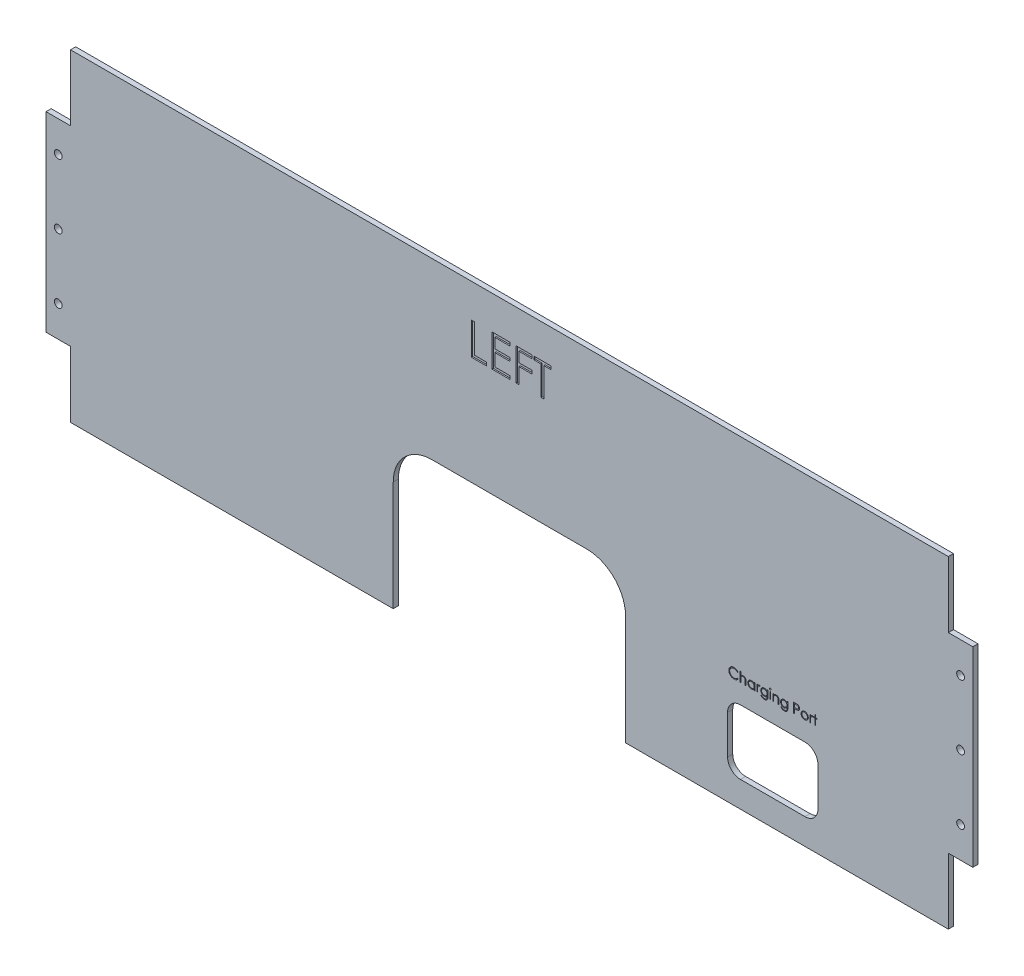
from build123d import *

# Parameters (mm, degrees)
BOSS_EXTRU_1_DEPTH      = 4
ESQUISSE2_R             = 3
ENL_V_MAT_EXTRU_1_DEPTH = 381.160492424
ESQUISSE3_W             = 180
ESQUISSE3_H             = 115
ENL_V_MAT_EXTRU_2_DEPTH = 381.160492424
CONG_1_R                = 30
ENL_V_MAT_EXTRU_3_DEPTH = 1
ENL_V_MAT_EXTRU_4_REACH = 382.16
ESQUISSE6_W             = 0.664850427
ESQUISSE6_H             = 5.413782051
ENL_V_MAT_EXTRU_5_DEPTH = 1


with BuildPart() as part:
    # Esquisse1 → Boss.-Extru.1 (new body)
    with BuildSketch(Plane.XY):
        Polygon((340, 125), (-340, 125), (-340, 74), (-359, 74), (-359, -74), (-340, -74), (-340, -125), (340, -125), (340, -74), (359, -74), (359, 74), (340, 74), align=None)
    extrude(amount=BOSS_EXTRU_1_DEPTH)

    # Esquisse2 → Enl_v. mat.-Extru.1 (cut, through all)
    with BuildSketch(Plane.XY.offset(4)):
        with Locations((-349.5, 50)):
            Circle(ESQUISSE2_R)
        with Locations((-349.5, -50)):
            Circle(ESQUISSE2_R)
        with Locations((-349.5, 0)):
            Circle(ESQUISSE2_R)
        with Locations(Location((349.5, 0, 0), (0, 0, 180))):
            Circle(ESQUISSE2_R)
        with Locations(Location((349.5, -50, 0), (0, 0, 180))):
            Circle(ESQUISSE2_R)
        with Locations(Location((349.5, 50, 0), (0, 0, 180))):
            Circle(ESQUISSE2_R)
    extrude(amount=-ENL_V_MAT_EXTRU_1_DEPTH, mode=Mode.SUBTRACT)

    # Esquisse3 → Enl_v. mat.-Extru.2 (cut, through all)
    with BuildSketch(Plane.XY.offset(4)):
        with Locations((0, -67.5)):
            Rectangle(ESQUISSE3_W, ESQUISSE3_H)
    extrude(amount=-ENL_V_MAT_EXTRU_2_DEPTH, mode=Mode.SUBTRACT)

    # Cong_1
    cong_1_edges = [part.edges().sort_by_distance(p)[0] for p in [
        (-90, -10, 2),
        (90, -10, 2),
    ]]
    fillet(cong_1_edges, radius=CONG_1_R)

    # Esquisse4 → Enl_v. mat.-Extru.3 (cut)
    with BuildSketch(Plane.XY.offset(4)):
        Polygon((-29.487179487, 99), (-27.243589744, 99), (-27.243589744, 76.564102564), (-17.628205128, 76.564102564), (-17.628205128, 74), (-29.487179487, 74), align=None)
        Polygon((-13.461538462, 99), (0.641025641, 99), (0.641025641, 96.435897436), (-11.217948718, 96.435897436), (-11.217948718, 88.743589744), (0.641025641, 88.743589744), (0.641025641, 86.179487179), (-11.217948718, 86.179487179), (-11.217948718, 76.564102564), (0.641025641, 76.564102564), (0.641025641, 74), (-13.461538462, 74), align=None)
        Polygon((5.128205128, 99), (17.307692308, 99), (17.307692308, 96.435897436), (7.371794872, 96.435897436), (7.371794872, 88.743589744), (17.307692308, 88.743589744), (17.307692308, 86.179487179), (7.371794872, 86.179487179), (7.371794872, 74), (5.128205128, 74), align=None)
        Polygon((18.91025641, 96.435897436), (18.91025641, 99), (32.051282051, 99), (32.051282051, 96.435897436), (26.602564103, 96.435897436), (26.602564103, 74), (24.358974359, 74), (24.358974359, 96.435897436), align=None)
    extrude(amount=-ENL_V_MAT_EXTRU_3_DEPTH, mode=Mode.SUBTRACT)

    # Esquisse5 → Enl_v. mat.-Extru.4 (cut, up to next)
    with BuildSketch(Plane.XY.offset(4), mode=Mode.PRIVATE) as enl_v_mat_extru_4_sk1:
        with BuildLine():
            Line((229, -55), (179, -55))
            ThreePointArc((179, -55), (171.928932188, -57.928932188), (169, -65))
            Line((169, -65), (169, -95))
            ThreePointArc((169, -95), (171.928932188, -102.071067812), (179, -105))
            Line((179, -105), (229, -105))
            ThreePointArc((229, -105), (236.071067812, -102.071067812), (239, -95))
            Line((239, -95), (239, -65))
            ThreePointArc((239, -65), (236.071067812, -57.928932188), (229, -55))
        make_face()
    enl_v_mat_extru_4_tool1 = extrude(enl_v_mat_extru_4_sk1.sketch, amount=-ENL_V_MAT_EXTRU_4_REACH, mode=Mode.PRIVATE) & part.part
    add(enl_v_mat_extru_4_tool1.solids().sort_by_distance((204, -80, 4))[0], mode=Mode.SUBTRACT)

    # Esquisse6 → Enl_v. mat.-Extru.5 (cut)
    # profile 1 of 13: a face of its own
    with BuildSketch(Plane.XY.offset(4)):
        with BuildLine():
            Line((177.216025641, -33.951048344), (176.634281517, -34.396260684))
            add(Edge.make_bspline(
                [(176.634281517, -34.396260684), (176.592782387, -34.346802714), (176.510343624, -34.248553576), (176.377714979, -34.110590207), (176.239493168, -33.981335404), (176.095731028, -33.860173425), (175.943840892, -33.751341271), (175.787502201, -33.649167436), (175.624099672, -33.557584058), (175.398141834, -33.446537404), (175.102553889, -33.330658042), (174.730454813, -33.233496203), (174.342022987, -33.171644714), (174.077021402, -33.1649458), (173.942230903, -33.161538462)],
                knots=[0, 0, 0, 0, 0.757959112, 1.505699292, 2.245454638, 2.979532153, 3.711538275, 4.438200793, 5.171680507, 5.909471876, 7.393775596, 8.890124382, 10.418191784, 12, 12, 12, 12], degree=3))
            add(Edge.make_bspline(
                [(173.942230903, -33.161538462), (173.867971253, -33.162393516), (173.720141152, -33.164095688), (173.500751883, -33.186551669), (173.285459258, -33.218113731), (173.074403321, -33.264945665), (172.867852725, -33.324154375), (172.664457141, -33.394904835), (172.467161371, -33.482439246), (172.273236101, -33.579188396), (172.087436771, -33.688466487), (171.911636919, -33.807663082), (171.746477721, -33.935444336), (171.591828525, -34.072289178), (171.447531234, -34.217581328), (171.314631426, -34.372869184), (171.193588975, -34.537656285), (171.082004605, -34.709769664), (170.982070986, -34.88870799), (170.898399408, -35.075133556), (170.824305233, -35.265853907), (170.765675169, -35.463023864), (170.719268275, -35.665256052), (170.687248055, -35.87309322), (170.665047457, -36.086101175), (170.663353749, -36.230477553), (170.6625, -36.303253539)],
                knots=[0, 0, 0, 0, 1.054917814, 2.100044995, 3.131103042, 4.146048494, 5.169673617, 6.183595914, 7.203665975, 8.234915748, 9.262203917, 10.264457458, 11.251630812, 12.227803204, 13.197192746, 14.159520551, 15.12972552, 16.100847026, 17.073214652, 18.039054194, 19.002613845, 19.979014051, 20.95965708, 21.949030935, 22.966165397, 24, 24, 24, 24], degree=3))
            add(Edge.make_bspline(
                [(170.6625, -36.303253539), (170.66517085, -36.412751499), (170.67041471, -36.627736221), (170.717083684, -36.942634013), (170.788002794, -37.244302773), (170.894292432, -37.530856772), (171.025354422, -37.805829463), (171.190963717, -38.06456837), (171.382768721, -38.310983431), (171.603482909, -38.539251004), (171.845641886, -38.747771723), (172.105458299, -38.931393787), (172.382285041, -39.084460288), (172.673065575, -39.211832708), (172.980037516, -39.309742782), (173.302648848, -39.378670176), (173.640197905, -39.423632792), (173.870849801, -39.427937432), (173.988236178, -39.430128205)],
                knots=[0, 0, 0, 0, 1.029171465, 2.020641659, 2.987623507, 3.938342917, 4.889210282, 5.84687017, 6.821220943, 7.821438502, 8.827599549, 9.822697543, 10.807740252, 11.797342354, 12.80366471, 13.83203677, 14.896651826, 16, 16, 16, 16], degree=3))
            add(Edge.make_bspline(
                [(173.988236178, -39.430128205), (174.117570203, -39.426553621), (174.372130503, -39.419517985), (174.745442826, -39.359914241), (175.102811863, -39.263271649), (175.444256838, -39.128021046), (175.768815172, -38.95219952), (176.07699477, -38.73905568), (176.369055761, -38.486562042), (176.544678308, -38.293769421), (176.634281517, -38.195405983)],
                knots=[0, 0, 0, 0, 1.028121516, 2.023589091, 2.998037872, 3.967518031, 4.937445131, 5.927275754, 6.942489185, 8, 8, 8, 8], degree=3))
            Line((176.634281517, -38.195405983), (177.216025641, -38.636166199))
            add(Edge.make_bspline(
                [(177.216025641, -38.636166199), (177.169208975, -38.696572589), (177.075799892, -38.817096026), (176.92454709, -38.987004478), (176.765210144, -39.146821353), (176.596605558, -39.295258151), (176.420672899, -39.435285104), (176.234253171, -39.56292398), (176.039797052, -39.679956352), (175.837963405, -39.787116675), (175.628966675, -39.882191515), (175.413057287, -39.963585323), (175.191165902, -40.033699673), (174.963282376, -40.091382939), (174.728934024, -40.136406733), (174.488966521, -40.166505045), (174.242861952, -40.18712543), (174.07682761, -40.189004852), (173.992688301, -40.189957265)],
                knots=[0, 0, 0, 0, 0.986787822, 1.968848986, 2.935600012, 3.899624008, 4.868462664, 5.837806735, 6.815139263, 7.798259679, 8.787526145, 9.778297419, 10.776456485, 11.791383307, 12.812564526, 13.85620153, 14.913611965, 16, 16, 16, 16], degree=3))
            add(Edge.make_bspline(
                [(173.992688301, -40.189957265), (173.913009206, -40.189402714), (173.755453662, -40.188306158), (173.522834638, -40.170542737), (173.296373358, -40.146307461), (173.076717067, -40.10981585), (172.862667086, -40.066753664), (172.656163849, -40.009029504), (172.455175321, -39.944367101), (172.260509, -39.868368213), (172.071999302, -39.782608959), (171.890254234, -39.685683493), (171.715357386, -39.57840688), (171.545589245, -39.463143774), (171.383457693, -39.336191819), (171.227557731, -39.199314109), (171.077015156, -39.052971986), (170.983876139, -38.94744588), (170.93704761, -38.894389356)],
                knots=[0, 0, 0, 0, 1.114604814, 2.203992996, 3.262667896, 4.300477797, 5.318619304, 6.316056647, 7.298880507, 8.271930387, 9.238335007, 10.195173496, 11.151986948, 12.108099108, 13.064862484, 14.031167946, 15.010108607, 16, 16, 16, 16], degree=3))
            add(Edge.make_bspline(
                [(170.93704761, -38.894389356), (170.862042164, -38.802227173), (170.712936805, -38.619015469), (170.522170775, -38.322076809), (170.358875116, -38.012052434), (170.226846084, -37.687313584), (170.123631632, -37.348588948), (170.052128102, -36.995707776), (170.005663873, -36.628999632), (170.000350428, -36.379578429), (169.997649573, -36.25279614)],
                knots=[0, 0, 0, 0, 0.994628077, 1.977248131, 2.950237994, 3.925870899, 4.908910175, 5.911660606, 6.938484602, 8, 8, 8, 8], degree=3))
            add(Edge.make_bspline(
                [(169.997649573, -36.25279614), (170.000941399, -36.11954043), (170.007417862, -35.85736814), (170.062442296, -35.472613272), (170.150958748, -35.103992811), (170.276682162, -34.752194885), (170.436078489, -34.415369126), (170.632984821, -34.096088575), (170.865113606, -33.792311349), (171.130644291, -33.508646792), (171.421828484, -33.249271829), (171.733653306, -33.021082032), (172.065508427, -32.831179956), (172.41373788, -32.672438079), (172.78094924, -32.550423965), (173.166359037, -32.46500972), (173.569243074, -32.411845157), (173.844118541, -32.405124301), (173.983784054, -32.401709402)],
                knots=[0, 0, 0, 0, 1.032925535, 2.032216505, 3.007276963, 3.968222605, 4.92396291, 5.891752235, 6.871517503, 7.883894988, 8.900124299, 9.891468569, 10.874487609, 11.85992873, 12.854644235, 13.869047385, 14.917252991, 16, 16, 16, 16], degree=3))
            add(Edge.make_bspline(
                [(173.983784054, -32.401709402), (174.068904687, -32.402729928), (174.237392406, -32.404749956), (174.48663552, -32.424447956), (174.729295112, -32.45728509), (174.965538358, -32.501980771), (175.196514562, -32.557452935), (175.420458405, -32.629716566), (175.638683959, -32.712343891), (175.849814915, -32.807505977), (176.052838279, -32.914327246), (176.24769082, -33.031623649), (176.432824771, -33.159249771), (176.609542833, -33.296120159), (176.774888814, -33.445130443), (176.933557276, -33.602182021), (177.080159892, -33.771798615), (177.170654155, -33.891189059), (177.216025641, -33.951048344)],
                knots=[0, 0, 0, 0, 1.096760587, 2.17092713, 3.219439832, 4.250915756, 5.268269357, 6.278326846, 7.281116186, 8.274029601, 9.260640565, 10.235837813, 11.203064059, 12.156899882, 13.114053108, 14.069676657, 15.032185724, 16, 16, 16, 16], degree=3))
        make_face()
    # profile 2 of 13: a face of its own
    with BuildSketch(Plane.XY.offset(4)):
        with BuildLine():
            Line((178.545726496, -32.401709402), (179.210576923, -32.401709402))
            Line((179.210576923, -32.401709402), (179.210576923, -35.608722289))
            add(Edge.make_bspline(
                [(179.210576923, -35.608722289), (179.281945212, -35.519517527), (179.420902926, -35.345831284), (179.654786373, -35.11921843), (179.894966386, -34.922794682), (180.149738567, -34.766435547), (180.414428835, -34.642914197), (180.690153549, -34.555310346), (180.976963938, -34.501438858), (181.171750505, -34.494668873), (181.270426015, -34.491239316)],
                knots=[0, 0, 0, 0, 1.125788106, 2.19196713, 3.20547328, 4.180437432, 5.132270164, 6.079753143, 7.027236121, 8, 8, 8, 8], degree=3))
            add(Edge.make_bspline(
                [(181.270426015, -34.491239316), (181.37060868, -34.49493381), (181.56669032, -34.502164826), (181.852189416, -34.55934315), (182.118806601, -34.65704306), (182.365749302, -34.790746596), (182.587628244, -34.957270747), (182.784160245, -35.149530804), (182.944689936, -35.372360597), (183.053908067, -35.578219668), (183.12497178, -35.761393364), (183.169954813, -35.918527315), (183.208095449, -36.093622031), (183.241326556, -36.286587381), (183.263474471, -36.498349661), (183.281264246, -36.727953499), (183.293914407, -36.975385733), (183.294404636, -37.146666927), (183.29465812, -37.23523137)],
                knots=[0, 0, 0, 0, 1.235656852, 2.418478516, 3.575258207, 4.727955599, 5.870717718, 6.98870536, 8.107142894, 9.245821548, 9.854588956, 10.528768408, 11.260415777, 12.065282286, 12.943670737, 13.886611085, 14.907229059, 16, 16, 16, 16], degree=3))
            Line((183.29465812, -37.23523137), (183.29465812, -40))
            Line((183.29465812, -40), (182.629807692, -40))
            Line((182.629807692, -40), (182.629807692, -37.453385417))
            add(Edge.make_bspline(
                [(182.629807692, -37.453385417), (182.629404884, -37.379677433), (182.62863438, -37.238686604), (182.626087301, -37.036828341), (182.620401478, -36.853744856), (182.611213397, -36.690022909), (182.601550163, -36.545434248), (182.588250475, -36.42018885), (182.572777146, -36.314114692), (182.558873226, -36.250266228), (182.552637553, -36.221631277)],
                knots=[0, 0, 0, 0, 1.430932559, 2.737130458, 3.918967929, 4.986496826, 5.920444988, 6.731744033, 7.431208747, 8, 8, 8, 8], degree=3))
            add(Edge.make_bspline(
                [(182.552637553, -36.221631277), (182.528456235, -36.137611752), (182.48196779, -35.976084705), (182.373916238, -35.756665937), (182.238959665, -35.569584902), (182.074182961, -35.417366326), (181.882501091, -35.297961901), (181.662664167, -35.215268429), (181.416741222, -35.163944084), (181.24348894, -35.158780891), (181.153186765, -35.156089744)],
                knots=[0, 0, 0, 0, 1.090059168, 2.095632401, 3.037101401, 3.955032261, 4.878929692, 5.839099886, 6.873700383, 8, 8, 8, 8], degree=3))
            add(Edge.make_bspline(
                [(181.153186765, -35.156089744), (181.099703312, -35.157096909), (180.99386094, -35.159090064), (180.836912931, -35.179100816), (180.68466308, -35.211800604), (180.535645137, -35.256048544), (180.393017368, -35.316258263), (180.252622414, -35.385960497), (180.118438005, -35.471279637), (179.988081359, -35.567007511), (179.866759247, -35.672988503), (179.753883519, -35.784847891), (179.653260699, -35.903963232), (179.562098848, -36.028423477), (179.48340481, -36.159935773), (179.414712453, -36.297231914), (179.356428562, -36.440492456), (179.327466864, -36.539923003), (179.312975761, -36.589673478)],
                knots=[0, 0, 0, 0, 1.024319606, 2.027102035, 3.025350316, 4.005802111, 5.00026367, 5.987881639, 7.005602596, 8.042517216, 9.083927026, 10.089214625, 11.084353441, 12.06828073, 13.041928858, 14.016821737, 15.00770877, 16, 16, 16, 16], degree=3))
            add(Edge.make_bspline(
                [(179.312975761, -36.589673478), (179.304637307, -36.625701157), (179.286466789, -36.704209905), (179.266750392, -36.833695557), (179.249102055, -36.984161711), (179.234182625, -37.155380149), (179.225032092, -37.347978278), (179.215172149, -37.560641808), (179.21150182, -37.794702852), (179.210894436, -37.95746501), (179.210576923, -38.042549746)],
                knots=[0, 0, 0, 0, 0.607992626, 1.324890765, 2.152360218, 3.099583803, 4.150613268, 5.323148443, 6.60066238, 8, 8, 8, 8], degree=3))
            Line((179.210576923, -38.042549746), (179.210576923, -40))
            Line((179.210576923, -40), (178.545726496, -40))
            Line((178.545726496, -40), (178.545726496, -32.401709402))
        make_face()
    # profile 3 of 13: a face of its own
    with BuildSketch(Plane.XY.offset(4)):
        with BuildLine():
            Line((190.323076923, -34.586217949), (190.323076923, -40))
            Line((190.323076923, -40), (189.658226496, -40))
            Line((189.658226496, -40), (189.658226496, -39.063570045))
            add(Edge.make_bspline(
                [(189.658226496, -39.063570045), (189.583256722, -39.148320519), (189.436952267, -39.313712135), (189.1926019, -39.529786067), (188.933589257, -39.708386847), (188.661171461, -39.852637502), (188.375594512, -39.960994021), (188.077491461, -40.038011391), (187.766740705, -40.087528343), (187.554539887, -40.092472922), (187.447005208, -40.094978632)],
                knots=[0, 0, 0, 0, 1.074387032, 2.096679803, 3.090159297, 4.057316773, 5.018401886, 5.985159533, 6.978961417, 8, 8, 8, 8], degree=3))
            add(Edge.make_bspline(
                [(187.447005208, -40.094978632), (187.351399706, -40.092382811), (187.162861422, -40.087263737), (186.885516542, -40.047550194), (186.618621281, -39.983773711), (186.361923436, -39.895083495), (186.117084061, -39.777437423), (185.882006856, -39.636591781), (185.657909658, -39.468865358), (185.448208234, -39.277120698), (185.2551005, -39.068851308), (185.085637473, -38.846716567), (184.944343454, -38.611677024), (184.82619095, -38.366708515), (184.735182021, -38.109925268), (184.671737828, -37.842215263), (184.632070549, -37.563895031), (184.626953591, -37.374369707), (184.624358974, -37.278268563)],
                knots=[0, 0, 0, 0, 1.033919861, 2.038935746, 3.024066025, 3.998881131, 4.97069526, 5.957263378, 6.95902576, 7.993208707, 9.027059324, 10.027763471, 11.009749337, 11.988697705, 12.965288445, 13.950418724, 14.960734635, 16, 16, 16, 16], degree=3))
            add(Edge.make_bspline(
                [(184.624358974, -37.278268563), (184.627011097, -37.184153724), (184.632254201, -36.998093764), (184.671313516, -36.724453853), (184.736995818, -36.460890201), (184.829172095, -36.208251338), (184.9473709, -35.966231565), (185.091152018, -35.734659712), (185.260525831, -35.512897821), (185.455793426, -35.306160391), (185.667322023, -35.115193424), (185.89361217, -34.949227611), (186.129034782, -34.805893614), (186.377241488, -34.69232709), (186.634558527, -34.600444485), (186.903276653, -34.536874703), (187.182277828, -34.499415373), (187.37169937, -34.493990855), (187.467781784, -34.491239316)],
                knots=[0, 0, 0, 0, 1.020392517, 2.01726096, 2.990465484, 3.961182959, 4.928053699, 5.906110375, 6.912531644, 7.948652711, 8.985773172, 9.998621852, 10.987621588, 11.969261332, 12.953316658, 13.946091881, 14.958173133, 16, 16, 16, 16], degree=3))
            add(Edge.make_bspline(
                [(187.467781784, -34.491239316), (187.578271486, -34.494282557), (187.794936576, -34.500250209), (188.111860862, -34.549912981), (188.411675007, -34.633814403), (188.696693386, -34.747939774), (188.965892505, -34.899596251), (189.216723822, -35.090900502), (189.451812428, -35.320646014), (189.588084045, -35.497113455), (189.658226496, -35.587945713)],
                knots=[0, 0, 0, 0, 1.038897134, 2.037228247, 3.008116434, 3.962042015, 4.918381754, 5.904844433, 6.921570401, 8, 8, 8, 8], degree=3))
            Line((189.658226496, -35.587945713), (189.658226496, -34.586217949))
            Line((189.658226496, -34.586217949), (190.323076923, -34.586217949))
        make_face()
        with BuildLine():
            add(Edge.make_bspline(
                [(187.476686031, -35.156089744), (187.379500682, -35.15954761), (187.187672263, -35.166372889), (186.906062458, -35.219656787), (186.636582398, -35.308312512), (186.380579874, -35.429559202), (186.142098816, -35.582020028), (185.928963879, -35.766426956), (185.739431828, -35.977748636), (185.580029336, -36.215031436), (185.450086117, -36.469408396), (185.358715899, -36.735313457), (185.298455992, -37.007950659), (185.292299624, -37.192868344), (185.289209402, -37.285688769)],
                knots=[0, 0, 0, 0, 1.031046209, 2.035121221, 3.029706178, 4.034933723, 5.034054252, 6.02443088, 7.017295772, 8.038157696, 9.050218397, 10.03989886, 11.016116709, 12, 12, 12, 12], degree=3))
            add(Edge.make_bspline(
                [(185.289209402, -37.285688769), (185.293156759, -37.377954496), (185.301036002, -37.562124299), (185.357658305, -37.835133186), (185.452654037, -38.101100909), (185.58228307, -38.357770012), (185.744603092, -38.596073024), (185.93275074, -38.81142295), (186.148545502, -38.996609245), (186.387575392, -39.151628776), (186.642862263, -39.276856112), (186.911327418, -39.363990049), (187.187924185, -39.420246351), (187.375994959, -39.426817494), (187.470749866, -39.430128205)],
                knots=[0, 0, 0, 0, 0.979072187, 1.954306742, 2.945804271, 3.96968567, 4.997920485, 5.998718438, 6.996577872, 8.005894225, 9.015743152, 10.005417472, 10.995077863, 12, 12, 12, 12], degree=3))
            add(Edge.make_bspline(
                [(187.470749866, -39.430128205), (187.566944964, -39.426614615), (187.758267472, -39.419626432), (188.040712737, -39.366114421), (188.314810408, -39.277703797), (188.576826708, -39.155150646), (188.820912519, -39.003264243), (189.039983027, -38.825449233), (189.22522516, -38.61864416), (189.382266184, -38.391364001), (189.505404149, -38.142206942), (189.595100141, -37.876916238), (189.648130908, -37.595482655), (189.654814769, -37.403154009), (189.658226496, -37.304981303)],
                knots=[0, 0, 0, 0, 1.01762866, 2.023962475, 3.030623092, 4.058876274, 5.077231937, 6.066672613, 7.034107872, 8.005628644, 8.981990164, 9.965428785, 10.961468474, 12, 12, 12, 12], degree=3))
            add(Edge.make_bspline(
                [(189.658226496, -37.304981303), (189.656195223, -37.230182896), (189.652197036, -37.082955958), (189.62165233, -36.866786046), (189.573064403, -36.659916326), (189.504598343, -36.462129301), (189.414658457, -36.274518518), (189.30618402, -36.095736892), (189.177267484, -35.926714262), (189.029984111, -35.769778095), (188.868767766, -35.626635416), (188.698175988, -35.49886444), (188.51618764, -35.393901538), (188.325863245, -35.307030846), (188.126872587, -35.237902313), (187.917596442, -35.191785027), (187.700259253, -35.160119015), (187.551995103, -35.157446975), (187.476686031, -35.156089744)],
                knots=[0, 0, 0, 0, 1.050140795, 2.067009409, 3.05949893, 4.030605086, 5.00011959, 5.97591094, 6.962425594, 7.979863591, 8.993523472, 9.986985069, 10.967611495, 11.937549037, 12.921786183, 13.919465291, 14.943216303, 16, 16, 16, 16], degree=3))
        make_face(mode=Mode.SUBTRACT)
    # profile 4 of 13: a face of its own
    with BuildSketch(Plane.XY.offset(4)):
        with BuildLine():
            Line((191.652777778, -34.586217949), (192.317628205, -34.586217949))
            Line((192.317628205, -34.586217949), (192.317628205, -35.383148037))
            add(Edge.make_bspline(
                [(192.317628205, -35.383148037), (192.366711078, -35.308946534), (192.46058169, -35.167036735), (192.616607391, -34.979353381), (192.776422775, -34.823958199), (192.940792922, -34.700125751), (193.110926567, -34.607387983), (193.283089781, -34.539457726), (193.459991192, -34.499289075), (193.578867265, -34.493926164), (193.638424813, -34.491239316)],
                knots=[0, 0, 0, 0, 1.2804753, 2.448899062, 3.506932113, 4.484331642, 5.4025378, 6.288909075, 7.142734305, 8, 8, 8, 8], degree=3))
            add(Edge.make_bspline(
                [(193.638424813, -34.491239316), (193.684623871, -34.493759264), (193.779681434, -34.498944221), (193.923577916, -34.5353738), (194.071836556, -34.593535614), (194.167387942, -34.648230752), (194.217200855, -34.676744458)],
                knots=[0, 0, 0, 0, 0.901110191, 1.854092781, 2.881294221, 4, 4, 4, 4], degree=3))
            Line((194.217200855, -34.676744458), (193.852126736, -35.252552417))
            add(Edge.make_bspline(
                [(193.852126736, -35.252552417), (193.820145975, -35.238285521), (193.759440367, -35.21120422), (193.670636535, -35.179153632), (193.588761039, -35.16028161), (193.536598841, -35.157422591), (193.512281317, -35.156089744)],
                knots=[0, 0, 0, 0, 1.180555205, 2.24091978, 3.179933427, 4, 4, 4, 4], degree=3))
            add(Edge.make_bspline(
                [(193.512281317, -35.156089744), (193.458929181, -35.159645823), (193.350106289, -35.166899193), (193.190330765, -35.22391967), (193.035290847, -35.316048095), (192.912160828, -35.418221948), (192.816821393, -35.516748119), (192.748791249, -35.602787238), (192.686386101, -35.699262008), (192.626759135, -35.804523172), (192.572432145, -35.920368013), (192.521728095, -36.045639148), (192.475883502, -36.180481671), (192.449742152, -36.274424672), (192.436351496, -36.322546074)],
                knots=[0, 0, 0, 0, 1.125678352, 2.296057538, 3.5422874, 4.923748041, 5.663163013, 6.437101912, 7.23742474, 8.08941207, 8.991984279, 9.93940061, 10.944477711, 12, 12, 12, 12], degree=3))
            add(Edge.make_bspline(
                [(192.436351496, -36.322546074), (192.426334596, -36.365466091), (192.404147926, -36.460530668), (192.382575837, -36.620018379), (192.361262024, -36.80845179), (192.346240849, -37.026355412), (192.332317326, -37.273185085), (192.324464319, -37.549316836), (192.317896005, -37.855034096), (192.31772018, -38.068763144), (192.317628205, -38.180565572)],
                knots=[0, 0, 0, 0, 0.566838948, 1.255505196, 2.06880316, 3.007127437, 4.065329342, 5.249902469, 6.561414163, 8, 8, 8, 8], degree=3))
            Line((192.317628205, -38.180565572), (192.317628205, -40))
            Line((192.317628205, -40), (191.652777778, -40))
            Line((191.652777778, -40), (191.652777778, -34.586217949))
        make_face()
    # profile 5 of 13: a face of its own
    with BuildSketch(Plane.XY.offset(4)):
        with BuildLine():
            Line((199.630982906, -34.586217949), (200.295833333, -34.586217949))
            Line((200.295833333, -34.586217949), (200.295833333, -38.882517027))
            add(Edge.make_bspline(
                [(200.295833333, -38.882517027), (200.295246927, -38.974036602), (200.29411502, -39.150691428), (200.285963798, -39.40612712), (200.268775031, -39.642063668), (200.249283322, -39.859577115), (200.221244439, -40.057659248), (200.187004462, -40.236901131), (200.148405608, -40.397474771), (200.114496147, -40.496375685), (200.098455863, -40.543159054)],
                knots=[0, 0, 0, 0, 1.307562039, 2.523909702, 3.650326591, 4.686913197, 5.643429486, 6.506965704, 7.293745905, 8, 8, 8, 8], degree=3))
            add(Edge.make_bspline(
                [(200.098455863, -40.543159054), (200.074771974, -40.603970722), (200.02811233, -40.723775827), (199.940724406, -40.893605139), (199.842862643, -41.053511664), (199.731088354, -41.20260427), (199.605906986, -41.340134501), (199.470267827, -41.469090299), (199.321529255, -41.586743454), (199.159776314, -41.691064), (198.988737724, -41.785016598), (198.808511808, -41.866395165), (198.620114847, -41.937275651), (198.42177706, -41.990367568), (198.216608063, -42.036372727), (198.002195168, -42.066312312), (197.779791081, -42.086689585), (197.628565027, -42.088573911), (197.551841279, -42.089529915)],
                knots=[0, 0, 0, 0, 0.981931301, 1.934503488, 2.87077864, 3.801706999, 4.735015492, 5.667491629, 6.616593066, 7.585388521, 8.561939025, 9.551802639, 10.560317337, 11.588439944, 12.640189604, 13.723962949, 14.845264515, 16, 16, 16, 16], degree=3))
            add(Edge.make_bspline(
                [(197.551841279, -42.089529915), (197.439901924, -42.08771702), (197.22125429, -42.084175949), (196.902473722, -42.042920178), (196.599716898, -41.984596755), (196.316984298, -41.896320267), (196.056062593, -41.788291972), (195.818733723, -41.664265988), (195.607128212, -41.522048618), (195.416366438, -41.360122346), (195.244193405, -41.167582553), (195.082210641, -40.940678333), (194.926294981, -40.675953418), (194.834921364, -40.481658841), (194.78707265, -40.37991453)],
                knots=[0, 0, 0, 0, 1.157897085, 2.2616841, 3.32207898, 4.345638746, 5.321241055, 6.241986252, 7.112515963, 7.955008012, 8.825025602, 9.77857164, 10.836726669, 12, 12, 12, 12], degree=3))
            Line((194.78707265, -40.37991453), (195.451923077, -40.37991453))
            add(Edge.make_bspline(
                [(195.451923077, -40.37991453), (195.505394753, -40.4648053), (195.609925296, -40.630756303), (195.805396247, -40.845625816), (196.019616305, -41.029253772), (196.259814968, -41.177231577), (196.526991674, -41.288800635), (196.821307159, -41.368335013), (197.145156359, -41.415952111), (197.370619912, -41.421691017), (197.488027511, -41.424679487)],
                knots=[0, 0, 0, 0, 0.997731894, 1.950442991, 2.880492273, 3.800895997, 4.748200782, 5.754801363, 6.83083817, 8, 8, 8, 8], degree=3))
            add(Edge.make_bspline(
                [(197.488027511, -41.424679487), (197.603950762, -41.421652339), (197.827439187, -41.4158163), (198.148815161, -41.368313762), (198.442174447, -41.288783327), (198.705826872, -41.177428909), (198.936661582, -41.041008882), (199.13565363, -40.888608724), (199.296826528, -40.716775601), (199.405227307, -40.558487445), (199.472610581, -40.417466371), (199.515520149, -40.296070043), (199.550390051, -40.158798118), (199.579557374, -40.00611081), (199.603625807, -39.837789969), (199.618871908, -39.653450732), (199.629890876, -39.453512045), (199.630610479, -39.314884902), (199.630982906, -39.243139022)],
                knots=[0, 0, 0, 0, 1.570740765, 3.028230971, 4.391408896, 5.680370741, 6.894727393, 8.017376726, 9.065722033, 10.075533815, 10.603371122, 11.180248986, 11.817768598, 12.521299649, 13.286540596, 14.121245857, 15.027658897, 16, 16, 16, 16], degree=3))
            Line((199.630982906, -39.243139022), (199.630982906, -38.962655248))
            add(Edge.make_bspline(
                [(199.630982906, -38.962655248), (199.563501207, -39.042965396), (199.429724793, -39.202173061), (199.198696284, -39.410795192), (198.946353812, -39.590470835), (198.673126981, -39.737830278), (198.385708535, -39.855689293), (198.087211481, -39.93811856), (197.78031163, -39.991373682), (197.57234458, -39.997104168), (197.467250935, -40)],
                knots=[0, 0, 0, 0, 1.012485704, 2.007162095, 2.997754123, 3.998611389, 4.999708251, 5.992315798, 6.98544096, 8, 8, 8, 8], degree=3))
            add(Edge.make_bspline(
                [(197.467250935, -40), (197.405367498, -39.998909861), (197.282332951, -39.996742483), (197.099548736, -39.977779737), (196.919461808, -39.950265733), (196.742492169, -39.909876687), (196.568384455, -39.858035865), (196.397426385, -39.793230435), (196.228233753, -39.719961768), (196.063882, -39.633659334), (195.906008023, -39.537642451), (195.755802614, -39.433631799), (195.61405254, -39.322171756), (195.482106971, -39.202163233), (195.360138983, -39.073779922), (195.246508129, -38.938390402), (195.143093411, -38.794104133), (195.047772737, -38.643552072), (194.965100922, -38.48573145), (194.892532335, -38.324064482), (194.829435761, -38.158896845), (194.779132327, -37.989675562), (194.740712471, -37.816507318), (194.712115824, -37.639675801), (194.695895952, -37.458636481), (194.693366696, -37.336671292), (194.692094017, -37.275300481)],
                knots=[0, 0, 0, 0, 1.028754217, 2.045334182, 3.052854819, 4.056607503, 5.061168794, 6.071104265, 7.095078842, 8.125279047, 9.155117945, 10.165957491, 11.161587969, 12.151493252, 13.128948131, 14.104219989, 15.088194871, 16.07871515, 17.064853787, 18.047899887, 19.02414258, 20.002704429, 20.980574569, 21.971845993, 22.979467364, 24, 24, 24, 24], degree=3))
            add(Edge.make_bspline(
                [(194.692094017, -37.275300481), (194.693192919, -37.213910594), (194.695386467, -37.091368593), (194.714332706, -36.909590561), (194.741358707, -36.730246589), (194.784131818, -36.555185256), (194.835614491, -36.382412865), (194.899376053, -36.213205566), (194.976039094, -36.047511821), (195.062843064, -35.88520893), (195.160387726, -35.728474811), (195.267348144, -35.579616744), (195.383853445, -35.439730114), (195.508296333, -35.307403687), (195.642196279, -35.183914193), (195.785484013, -35.069561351), (195.936747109, -34.962428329), (196.096454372, -34.864825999), (196.262141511, -34.778503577), (196.429599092, -34.699736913), (196.601045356, -34.637223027), (196.773283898, -34.582140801), (196.94934805, -34.543119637), (197.127079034, -34.513015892), (197.307085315, -34.494675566), (197.42763561, -34.492386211), (197.488027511, -34.491239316)],
                knots=[0, 0, 0, 0, 1.008818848, 2.013730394, 3.001654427, 3.987803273, 4.973046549, 5.963777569, 6.957074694, 7.972068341, 8.987420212, 9.989399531, 10.982630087, 11.977756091, 12.973280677, 13.973972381, 14.989194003, 16.018387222, 17.047741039, 18.059210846, 19.057554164, 20.045176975, 21.029480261, 22.018708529, 23.007435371, 24, 24, 24, 24], degree=3))
            add(Edge.make_bspline(
                [(197.488027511, -34.491239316), (197.587618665, -34.494110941), (197.784280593, -34.499781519), (198.073694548, -34.544276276), (198.35297229, -34.615214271), (198.623689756, -34.716847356), (198.888052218, -34.855594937), (199.145188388, -35.038354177), (199.395842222, -35.266764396), (199.55052363, -35.441924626), (199.630982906, -35.533036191)],
                knots=[0, 0, 0, 0, 0.96728863, 1.910097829, 2.838038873, 3.762875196, 4.71315279, 5.730631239, 6.819562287, 8, 8, 8, 8], degree=3))
            Line((199.630982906, -35.533036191), (199.630982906, -34.586217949))
        make_face()
        with BuildLine():
            add(Edge.make_bspline(
                [(197.541452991, -35.156089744), (197.444233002, -35.159393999), (197.251758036, -35.165935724), (196.969631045, -35.221783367), (196.697264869, -35.309298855), (196.439866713, -35.434484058), (196.19876333, -35.587083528), (195.984821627, -35.771953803), (195.797697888, -35.983083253), (195.639407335, -36.218562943), (195.513399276, -36.472610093), (195.424195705, -36.740391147), (195.366516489, -37.017579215), (195.360150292, -37.206751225), (195.356944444, -37.302013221)],
                knots=[0, 0, 0, 0, 1.026226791, 2.031711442, 3.026614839, 4.04107745, 5.047145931, 6.032893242, 7.017642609, 8.019221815, 9.021877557, 10.003543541, 10.994637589, 12, 12, 12, 12], degree=3))
            add(Edge.make_bspline(
                [(195.356944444, -37.302013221), (195.35848063, -37.373838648), (195.361501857, -37.515098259), (195.390550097, -37.722400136), (195.437499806, -37.919843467), (195.504041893, -38.107440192), (195.586491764, -38.286266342), (195.690192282, -38.455090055), (195.812220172, -38.614061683), (195.951620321, -38.762005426), (196.105240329, -38.896754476), (196.271862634, -39.015156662), (196.451261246, -39.111995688), (196.639023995, -39.195690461), (196.839706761, -39.256817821), (197.050418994, -39.30346657), (197.272651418, -39.330155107), (197.424144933, -39.333463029), (197.501383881, -39.335149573)],
                knots=[0, 0, 0, 0, 1.039728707, 2.044842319, 3.024901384, 3.974314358, 4.923051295, 5.871625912, 6.837440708, 7.820715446, 8.810779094, 9.792721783, 10.773906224, 11.758876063, 12.764959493, 13.806266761, 14.881525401, 16, 16, 16, 16], degree=3))
            add(Edge.make_bspline(
                [(197.501383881, -39.335149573), (197.579623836, -39.3335248), (197.732621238, -39.330347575), (197.95607972, -39.30303517), (198.167815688, -39.258961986), (198.367634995, -39.196386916), (198.5562921, -39.116542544), (198.731667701, -39.015500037), (198.897522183, -38.900428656), (199.048559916, -38.766206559), (199.185136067, -38.61828332), (199.304157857, -38.457321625), (199.405576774, -38.285743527), (199.489561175, -38.103568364), (199.553677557, -37.909380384), (199.596685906, -37.703665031), (199.62675685, -37.487407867), (199.629552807, -37.339222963), (199.630982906, -37.263428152)],
                knots=[0, 0, 0, 0, 1.121943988, 2.193949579, 3.223793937, 4.220241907, 5.192961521, 6.155822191, 7.11847367, 8.083710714, 9.04790392, 10.001595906, 10.949595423, 11.902125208, 12.873731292, 13.87582262, 14.913508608, 16, 16, 16, 16], degree=3))
            add(Edge.make_bspline(
                [(199.630982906, -37.263428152), (199.628147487, -37.164753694), (199.622608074, -36.971978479), (199.570332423, -36.691082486), (199.486046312, -36.426988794), (199.367837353, -36.180532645), (199.219708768, -35.954325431), (199.041293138, -35.752556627), (198.835667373, -35.574966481), (198.603422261, -35.427015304), (198.353555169, -35.307496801), (198.09210197, -35.21783105), (197.819450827, -35.167043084), (197.63465226, -35.15976187), (197.541452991, -35.156089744)],
                knots=[0, 0, 0, 0, 1.070913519, 2.092188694, 3.091357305, 4.074328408, 5.051968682, 6.018948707, 6.99050112, 7.9935919, 9.000589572, 9.992915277, 10.987769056, 12, 12, 12, 12], degree=3))
        make_face(mode=Mode.SUBTRACT)
    # profile 6 of 13: a face of its own
    with BuildSketch(Plane.XY.offset(4)):
        with BuildLine():
            add(Edge.make_bspline(
                [(202.049969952, -32.306730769), (202.09122657, -32.308644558), (202.172014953, -32.312392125), (202.288840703, -32.344483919), (202.395218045, -32.398881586), (202.489574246, -32.471863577), (202.57054074, -32.557693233), (202.627226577, -32.657728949), (202.663659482, -32.765803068), (202.668059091, -32.84118834), (202.670299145, -32.879570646)],
                knots=[0, 0, 0, 0, 1.055194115, 2.066272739, 3.074728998, 4.095836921, 5.109056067, 6.073838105, 7.019297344, 8, 8, 8, 8], degree=3))
            add(Edge.make_bspline(
                [(202.670299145, -32.879570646), (202.668008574, -32.916956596), (202.663480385, -32.990864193), (202.627254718, -33.097064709), (202.570057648, -33.195710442), (202.489626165, -33.281373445), (202.395204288, -33.354315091), (202.288844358, -33.408723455), (202.172013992, -33.440812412), (202.091226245, -33.44456037), (202.049969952, -33.446474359)],
                knots=[0, 0, 0, 0, 0.96129708, 1.900370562, 2.859976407, 3.87933698, 4.906634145, 5.921202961, 6.938410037, 8, 8, 8, 8], degree=3))
            add(Edge.make_bspline(
                [(202.049969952, -33.446474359), (202.009185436, -33.444633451), (201.929803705, -33.441050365), (201.814727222, -33.408093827), (201.709256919, -33.354296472), (201.614716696, -33.281851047), (201.535912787, -33.195184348), (201.478554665, -33.097124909), (201.442412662, -32.990848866), (201.437873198, -32.916951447), (201.435576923, -32.879570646)],
                knots=[0, 0, 0, 0, 1.054934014, 2.053291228, 3.073705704, 4.106921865, 5.123545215, 6.088680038, 7.033164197, 8, 8, 8, 8], degree=3))
            add(Edge.make_bspline(
                [(201.435576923, -32.879570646), (201.43782289, -32.841193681), (201.44223411, -32.765818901), (201.478581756, -32.657667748), (201.535435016, -32.558223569), (201.614768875, -32.471386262), (201.709243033, -32.398900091), (201.81473081, -32.345113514), (201.929802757, -32.312154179), (202.009185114, -32.308571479), (202.049969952, -32.306730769)],
                knots=[0, 0, 0, 0, 0.98631895, 1.937192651, 2.907499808, 3.917963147, 4.944918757, 5.95915025, 6.951458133, 8, 8, 8, 8], degree=3))
        make_face()
    # profile 7 of 13: a face of its own
    with BuildSketch(Plane.XY.offset(4)):
        with Locations((202.052938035, -37.293108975)):
            Rectangle(ESQUISSE6_W, ESQUISSE6_H)
    # profile 8 of 13: a face of its own
    with BuildSketch(Plane.XY.offset(4)):
        with BuildLine():
            Line((204, -34.586217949), (204.664850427, -34.586217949))
            Line((204.664850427, -34.586217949), (204.664850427, -35.562717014))
            add(Edge.make_bspline(
                [(204.664850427, -35.562717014), (204.735838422, -35.474149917), (204.873593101, -35.302282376), (205.103006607, -35.076390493), (205.345457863, -34.890239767), (205.599462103, -34.741853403), (205.865364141, -34.629994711), (206.141543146, -34.549210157), (206.429652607, -34.500770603), (206.625580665, -34.494441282), (206.724699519, -34.491239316)],
                knots=[0, 0, 0, 0, 1.12780773, 2.188550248, 3.19190651, 4.159438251, 5.104880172, 6.052711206, 7.014878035, 8, 8, 8, 8], degree=3))
            add(Edge.make_bspline(
                [(206.724699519, -34.491239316), (206.824882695, -34.494933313), (207.020965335, -34.502163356), (207.306457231, -34.559348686), (207.573100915, -34.657022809), (207.819945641, -34.790821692), (208.042464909, -34.957205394), (208.237885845, -35.151045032), (208.399521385, -35.374006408), (208.507889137, -35.580853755), (208.579275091, -35.764345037), (208.624216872, -35.921500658), (208.66238245, -36.096587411), (208.69546965, -36.289076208), (208.71785787, -36.50031571), (208.73551572, -36.729439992), (208.748170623, -36.976374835), (208.748672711, -37.147161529), (208.748931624, -37.23523137)],
                knots=[0, 0, 0, 0, 1.235846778, 2.418850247, 3.575807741, 4.728682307, 5.871620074, 6.994088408, 8.11269785, 9.256955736, 9.865816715, 10.540099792, 11.271859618, 12.076849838, 12.949306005, 13.892391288, 14.913166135, 16, 16, 16, 16], degree=3))
            Line((208.748931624, -37.23523137), (208.748931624, -40))
            Line((208.748931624, -40), (208.084081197, -40))
            Line((208.084081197, -40), (208.084081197, -37.453385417))
            add(Edge.make_bspline(
                [(208.084081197, -37.453385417), (208.08367224, -37.379677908), (208.082889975, -37.238687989), (208.080422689, -37.036823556), (208.074475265, -36.853760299), (208.066118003, -36.689935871), (208.053885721, -36.545507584), (208.041137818, -36.420181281), (208.025548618, -36.314116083), (208.011657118, -36.250266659), (208.005427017, -36.221631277)],
                knots=[0, 0, 0, 0, 1.430800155, 2.736877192, 3.918605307, 4.986035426, 5.920637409, 6.731861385, 7.431261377, 8, 8, 8, 8], degree=3))
            add(Edge.make_bspline(
                [(208.005427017, -36.221631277), (207.982936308, -36.137575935), (207.939648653, -35.975795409), (207.832685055, -35.756351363), (207.697611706, -35.569665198), (207.532727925, -35.416891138), (207.339626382, -35.2979962), (207.118842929, -35.215501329), (206.87250814, -35.163904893), (206.699249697, -35.158767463), (206.608944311, -35.156089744)],
                knots=[0, 0, 0, 0, 1.084156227, 2.086665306, 3.027808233, 3.945421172, 4.874247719, 5.839848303, 6.874090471, 8, 8, 8, 8], degree=3))
            add(Edge.make_bspline(
                [(206.608944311, -35.156089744), (206.555461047, -35.157097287), (206.44961905, -35.159091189), (206.292668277, -35.179096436), (206.140428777, -35.211816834), (205.991372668, -35.255988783), (205.848481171, -35.316657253), (205.707163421, -35.385511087), (205.57274077, -35.471338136), (205.442346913, -35.566991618), (205.321034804, -35.672992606), (205.208156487, -35.784846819), (205.107534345, -35.903963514), (205.016372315, -36.028423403), (204.937678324, -36.159935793), (204.868985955, -36.297231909), (204.810702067, -36.440492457), (204.781740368, -36.539923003), (204.767249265, -36.589673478)],
                knots=[0, 0, 0, 0, 1.023777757, 2.026029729, 3.023749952, 4.003683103, 4.997618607, 5.993177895, 7.010360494, 8.046726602, 9.087585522, 10.09234134, 11.086953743, 12.070360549, 13.043493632, 14.017870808, 15.008233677, 16, 16, 16, 16], degree=3))
            add(Edge.make_bspline(
                [(204.767249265, -36.589673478), (204.758910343, -36.626196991), (204.740756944, -36.705706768), (204.72114988, -36.836187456), (204.703353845, -36.987126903), (204.68845895, -37.158348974), (204.679345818, -37.350453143), (204.669409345, -37.562619), (204.665791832, -37.79569255), (204.665173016, -37.9579598), (204.664850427, -38.042549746)],
                knots=[0, 0, 0, 0, 0.615963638, 1.340920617, 2.168419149, 3.115676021, 4.16674242, 5.331190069, 6.6087489, 8, 8, 8, 8], degree=3))
            Line((204.664850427, -38.042549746), (204.664850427, -40))
            Line((204.664850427, -40), (204, -40))
            Line((204, -40), (204, -34.586217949))
        make_face()
    # profile 9 of 13: a face of its own
    with BuildSketch(Plane.XY.offset(4)):
        with BuildLine():
            Line((215.017521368, -34.586217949), (215.682371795, -34.586217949))
            Line((215.682371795, -34.586217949), (215.682371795, -38.882517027))
            add(Edge.make_bspline(
                [(215.682371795, -38.882517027), (215.681785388, -38.974036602), (215.680653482, -39.150691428), (215.672502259, -39.40612712), (215.655313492, -39.642063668), (215.635821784, -39.859577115), (215.607782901, -40.057659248), (215.573542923, -40.236901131), (215.534944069, -40.397474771), (215.501034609, -40.496375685), (215.484994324, -40.543159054)],
                knots=[0, 0, 0, 0, 1.307562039, 2.523909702, 3.650326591, 4.686913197, 5.643429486, 6.506965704, 7.293745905, 8, 8, 8, 8], degree=3))
            add(Edge.make_bspline(
                [(215.484994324, -40.543159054), (215.461310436, -40.603970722), (215.414650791, -40.723775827), (215.327262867, -40.893605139), (215.229401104, -41.053511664), (215.117626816, -41.20260427), (214.992445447, -41.340134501), (214.856806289, -41.469090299), (214.708067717, -41.586743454), (214.546314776, -41.691064), (214.375276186, -41.785016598), (214.19505027, -41.866395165), (214.006653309, -41.937275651), (213.808315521, -41.990367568), (213.603146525, -42.036372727), (213.388733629, -42.066312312), (213.166329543, -42.086689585), (213.015103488, -42.088573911), (212.938379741, -42.089529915)],
                knots=[0, 0, 0, 0, 0.981931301, 1.934503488, 2.87077864, 3.801706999, 4.735015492, 5.667491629, 6.616593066, 7.585388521, 8.561939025, 9.551802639, 10.560317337, 11.588439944, 12.640189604, 13.723962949, 14.845264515, 16, 16, 16, 16], degree=3))
            add(Edge.make_bspline(
                [(212.938379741, -42.089529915), (212.826440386, -42.08771702), (212.607792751, -42.084175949), (212.289012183, -42.042920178), (211.986255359, -41.984596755), (211.703522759, -41.896320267), (211.442601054, -41.788291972), (211.205272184, -41.664265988), (210.993666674, -41.522048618), (210.802904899, -41.360122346), (210.630731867, -41.167582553), (210.468749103, -40.940678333), (210.312833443, -40.675953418), (210.221459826, -40.481658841), (210.173611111, -40.37991453)],
                knots=[0, 0, 0, 0, 1.157897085, 2.2616841, 3.32207898, 4.345638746, 5.321241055, 6.241986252, 7.112515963, 7.955008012, 8.825025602, 9.77857164, 10.836726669, 12, 12, 12, 12], degree=3))
            Line((210.173611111, -40.37991453), (210.838461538, -40.37991453))
            add(Edge.make_bspline(
                [(210.838461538, -40.37991453), (210.891933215, -40.4648053), (210.996463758, -40.630756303), (211.191934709, -40.845625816), (211.406154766, -41.029253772), (211.646353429, -41.177231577), (211.913530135, -41.288800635), (212.207845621, -41.368335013), (212.53169482, -41.415952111), (212.757158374, -41.421691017), (212.874565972, -41.424679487)],
                knots=[0, 0, 0, 0, 0.997731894, 1.950442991, 2.880492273, 3.800895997, 4.748200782, 5.754801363, 6.83083817, 8, 8, 8, 8], degree=3))
            add(Edge.make_bspline(
                [(212.874565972, -41.424679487), (212.990489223, -41.421652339), (213.213977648, -41.4158163), (213.535353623, -41.368313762), (213.828712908, -41.288783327), (214.092365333, -41.177428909), (214.323200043, -41.041008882), (214.522192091, -40.888608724), (214.683364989, -40.716775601), (214.791765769, -40.558487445), (214.859149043, -40.417466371), (214.90205861, -40.296070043), (214.936928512, -40.158798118), (214.966095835, -40.00611081), (214.990164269, -39.837789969), (215.005410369, -39.653450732), (215.016429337, -39.453512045), (215.01714894, -39.314884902), (215.017521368, -39.243139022)],
                knots=[0, 0, 0, 0, 1.570740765, 3.028230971, 4.391408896, 5.680370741, 6.894727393, 8.017376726, 9.065722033, 10.075533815, 10.603371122, 11.180248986, 11.817768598, 12.521299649, 13.286540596, 14.121245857, 15.027658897, 16, 16, 16, 16], degree=3))
            Line((215.017521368, -39.243139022), (215.017521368, -38.962655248))
            add(Edge.make_bspline(
                [(215.017521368, -38.962655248), (214.950039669, -39.042965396), (214.816263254, -39.202173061), (214.585234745, -39.410795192), (214.332892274, -39.590470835), (214.059665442, -39.737830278), (213.772246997, -39.855689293), (213.473749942, -39.93811856), (213.166850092, -39.991373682), (212.958883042, -39.997104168), (212.853789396, -40)],
                knots=[0, 0, 0, 0, 1.012485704, 2.007162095, 2.997754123, 3.998611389, 4.999708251, 5.992315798, 6.98544096, 8, 8, 8, 8], degree=3))
            add(Edge.make_bspline(
                [(212.853789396, -40), (212.791905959, -39.998909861), (212.668871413, -39.996742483), (212.486087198, -39.977779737), (212.30600027, -39.950265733), (212.12903063, -39.909876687), (211.954922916, -39.858035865), (211.783964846, -39.793230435), (211.614772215, -39.719961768), (211.450420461, -39.633659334), (211.292546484, -39.537642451), (211.142341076, -39.433631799), (211.000591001, -39.322171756), (210.868645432, -39.202163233), (210.746677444, -39.073779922), (210.63304659, -38.938390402), (210.529631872, -38.794104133), (210.434311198, -38.643552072), (210.351639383, -38.48573145), (210.279070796, -38.324064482), (210.215974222, -38.158896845), (210.165670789, -37.989675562), (210.127250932, -37.816507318), (210.098654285, -37.639675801), (210.082434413, -37.458636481), (210.079905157, -37.336671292), (210.078632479, -37.275300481)],
                knots=[0, 0, 0, 0, 1.028754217, 2.045334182, 3.052854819, 4.056607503, 5.061168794, 6.071104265, 7.095078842, 8.125279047, 9.155117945, 10.165957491, 11.161587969, 12.151493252, 13.128948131, 14.104219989, 15.088194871, 16.07871515, 17.064853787, 18.047899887, 19.02414258, 20.002704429, 20.980574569, 21.971845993, 22.979467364, 24, 24, 24, 24], degree=3))
            add(Edge.make_bspline(
                [(210.078632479, -37.275300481), (210.079731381, -37.213910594), (210.081924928, -37.091368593), (210.100871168, -36.909590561), (210.127897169, -36.730246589), (210.17067028, -36.555185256), (210.222152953, -36.382412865), (210.285914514, -36.213205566), (210.362577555, -36.047511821), (210.449381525, -35.88520893), (210.546926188, -35.728474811), (210.653886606, -35.579616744), (210.770391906, -35.439730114), (210.894834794, -35.307403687), (211.02873474, -35.183914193), (211.172022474, -35.069561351), (211.323285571, -34.962428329), (211.482992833, -34.864825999), (211.648679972, -34.778503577), (211.816137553, -34.699736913), (211.987583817, -34.637223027), (212.159822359, -34.582140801), (212.335886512, -34.543119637), (212.513617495, -34.513015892), (212.693623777, -34.494675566), (212.814174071, -34.492386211), (212.874565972, -34.491239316)],
                knots=[0, 0, 0, 0, 1.008818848, 2.013730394, 3.001654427, 3.987803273, 4.973046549, 5.963777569, 6.957074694, 7.972068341, 8.987420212, 9.989399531, 10.982630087, 11.977756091, 12.973280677, 13.973972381, 14.989194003, 16.018387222, 17.047741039, 18.059210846, 19.057554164, 20.045176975, 21.029480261, 22.018708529, 23.007435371, 24, 24, 24, 24], degree=3))
            add(Edge.make_bspline(
                [(212.874565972, -34.491239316), (212.974157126, -34.494110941), (213.170819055, -34.499781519), (213.46023301, -34.544276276), (213.739510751, -34.615214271), (214.010228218, -34.716847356), (214.274590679, -34.855594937), (214.53172685, -35.038354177), (214.782380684, -35.266764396), (214.937062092, -35.441924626), (215.017521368, -35.533036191)],
                knots=[0, 0, 0, 0, 0.96728863, 1.910097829, 2.838038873, 3.762875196, 4.71315279, 5.730631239, 6.819562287, 8, 8, 8, 8], degree=3))
            Line((215.017521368, -35.533036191), (215.017521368, -34.586217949))
        make_face()
        with BuildLine():
            add(Edge.make_bspline(
                [(212.927991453, -35.156089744), (212.830771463, -35.159393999), (212.638296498, -35.165935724), (212.356169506, -35.221783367), (212.083803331, -35.309298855), (211.826405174, -35.434484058), (211.585301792, -35.587083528), (211.371360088, -35.771953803), (211.184236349, -35.983083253), (211.025945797, -36.218562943), (210.899937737, -36.472610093), (210.810734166, -36.740391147), (210.75305495, -37.017579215), (210.746688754, -37.206751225), (210.743482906, -37.302013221)],
                knots=[0, 0, 0, 0, 1.026226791, 2.031711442, 3.026614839, 4.04107745, 5.047145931, 6.032893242, 7.017642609, 8.019221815, 9.021877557, 10.003543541, 10.994637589, 12, 12, 12, 12], degree=3))
            add(Edge.make_bspline(
                [(210.743482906, -37.302013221), (210.745019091, -37.373838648), (210.748040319, -37.515098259), (210.777088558, -37.722400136), (210.824038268, -37.919843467), (210.890580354, -38.107440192), (210.973030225, -38.286266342), (211.076730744, -38.455090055), (211.198758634, -38.614061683), (211.338158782, -38.762005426), (211.491778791, -38.896754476), (211.658401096, -39.015156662), (211.837799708, -39.111995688), (212.025562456, -39.195690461), (212.226245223, -39.256817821), (212.436957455, -39.30346657), (212.659189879, -39.330155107), (212.810683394, -39.333463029), (212.887922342, -39.335149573)],
                knots=[0, 0, 0, 0, 1.039728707, 2.044842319, 3.024901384, 3.974314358, 4.923051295, 5.871625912, 6.837440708, 7.820715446, 8.810779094, 9.792721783, 10.773906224, 11.758876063, 12.764959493, 13.806266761, 14.881525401, 16, 16, 16, 16], degree=3))
            add(Edge.make_bspline(
                [(212.887922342, -39.335149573), (212.966162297, -39.3335248), (213.1191597, -39.330347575), (213.342618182, -39.30303517), (213.554354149, -39.258961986), (213.754173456, -39.196386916), (213.942830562, -39.116542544), (214.118206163, -39.015500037), (214.284060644, -38.900428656), (214.435098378, -38.766206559), (214.571674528, -38.61828332), (214.690696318, -38.457321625), (214.792115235, -38.285743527), (214.876099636, -38.103568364), (214.940216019, -37.909380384), (214.983224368, -37.703665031), (215.013295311, -37.487407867), (215.016091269, -37.339222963), (215.017521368, -37.263428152)],
                knots=[0, 0, 0, 0, 1.121943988, 2.193949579, 3.223793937, 4.220241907, 5.192961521, 6.155822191, 7.11847367, 8.083710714, 9.04790392, 10.001595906, 10.949595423, 11.902125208, 12.873731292, 13.87582262, 14.913508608, 16, 16, 16, 16], degree=3))
            add(Edge.make_bspline(
                [(215.017521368, -37.263428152), (215.014685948, -37.164753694), (215.009146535, -36.971978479), (214.956870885, -36.691082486), (214.872584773, -36.426988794), (214.754375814, -36.180532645), (214.606247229, -35.954325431), (214.427831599, -35.752556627), (214.222205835, -35.574966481), (213.989960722, -35.427015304), (213.74009363, -35.307496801), (213.478640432, -35.21783105), (213.205989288, -35.167043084), (213.021190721, -35.15976187), (212.927991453, -35.156089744)],
                knots=[0, 0, 0, 0, 1.070913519, 2.092188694, 3.091357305, 4.074328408, 5.051968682, 6.018948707, 6.99050112, 7.9935919, 9.000589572, 9.992915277, 10.987769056, 12, 12, 12, 12], degree=3))
        make_face(mode=Mode.SUBTRACT)
    # profile 10 of 13: a face of its own
    with BuildSketch(Plane.XY.offset(4)):
        with BuildLine():
            Line((220.241346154, -32.591666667), (221.694222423, -32.591666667))
            add(Edge.make_bspline(
                [(221.694222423, -32.591666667), (221.794152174, -32.591776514), (221.985622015, -32.591986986), (222.26018555, -32.598368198), (222.509549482, -32.606891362), (222.733176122, -32.61870637), (222.931753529, -32.632669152), (223.104383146, -32.652252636), (223.252421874, -32.672700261), (223.341123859, -32.693488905), (223.38157719, -32.702969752)],
                knots=[0, 0, 0, 0, 1.415646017, 2.712440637, 3.8905458, 4.950247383, 5.884950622, 6.709939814, 7.411656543, 8, 8, 8, 8], degree=3))
            add(Edge.make_bspline(
                [(223.38157719, -32.702969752), (223.432786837, -32.716986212), (223.533999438, -32.744688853), (223.67983998, -32.800174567), (223.818595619, -32.86596515), (223.950742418, -32.940945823), (224.074656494, -33.028333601), (224.192186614, -33.124586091), (224.302295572, -33.231925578), (224.404364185, -33.349148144), (224.49810034, -33.474285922), (224.578808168, -33.609206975), (224.646387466, -33.751640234), (224.704348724, -33.901486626), (224.746064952, -34.060004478), (224.77749089, -34.226092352), (224.797437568, -34.399732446), (224.799347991, -34.518392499), (224.800320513, -34.578797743)],
                knots=[0, 0, 0, 0, 0.999701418, 1.975846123, 2.934577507, 3.890451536, 4.834027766, 5.787354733, 6.749476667, 7.726910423, 8.712836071, 9.690891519, 10.682875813, 11.679750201, 12.712814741, 13.765529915, 14.8625177, 16, 16, 16, 16], degree=3))
            add(Edge.make_bspline(
                [(224.800320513, -34.578797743), (224.799428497, -34.639710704), (224.797683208, -34.758891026), (224.776736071, -34.933246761), (224.748520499, -35.099867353), (224.705135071, -35.258383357), (224.64831173, -35.407853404), (224.581653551, -35.550561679), (224.501255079, -35.684080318), (224.408873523, -35.80889405), (224.306105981, -35.925120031), (224.193387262, -36.031916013), (224.071172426, -36.128656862), (223.939849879, -36.215559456), (223.798139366, -36.290608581), (223.648190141, -36.35782821), (223.48869885, -36.414281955), (223.378330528, -36.443978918), (223.322215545, -36.459077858)],
                knots=[0, 0, 0, 0, 1.121902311, 2.195077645, 3.232258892, 4.234102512, 5.217864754, 6.176164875, 7.132989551, 8.084763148, 9.034132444, 9.988522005, 10.94243251, 11.903244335, 12.886203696, 13.894208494, 14.929344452, 16, 16, 16, 16], degree=3))
            add(Edge.make_bspline(
                [(223.322215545, -36.459077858), (223.275802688, -36.468947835), (223.174086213, -36.490578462), (223.006567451, -36.514726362), (222.811526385, -36.535337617), (222.589229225, -36.550791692), (222.33987551, -36.564021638), (222.063330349, -36.574537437), (221.759050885, -36.580315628), (221.546810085, -36.580613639), (221.435999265, -36.580769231)],
                knots=[0, 0, 0, 0, 0.601384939, 1.31797006, 2.144135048, 3.087295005, 4.142315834, 5.309527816, 6.595305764, 8, 8, 8, 8], degree=3))
            Line((221.435999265, -36.580769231), (220.906196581, -36.580769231))
            Line((220.906196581, -36.580769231), (220.906196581, -40))
            Line((220.906196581, -40), (220.241346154, -40))
            Line((220.241346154, -40), (220.241346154, -32.591666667))
        make_face()
        with BuildLine():
            Line((220.906196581, -33.351495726), (220.906196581, -35.820940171))
            Line((220.906196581, -35.820940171), (222.203248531, -35.837264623))
            add(Edge.make_bspline(
                [(222.203248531, -35.837264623), (222.266579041, -35.837297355), (222.388837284, -35.837360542), (222.565443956, -35.828925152), (222.729293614, -35.819187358), (222.879882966, -35.804929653), (223.017279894, -35.784776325), (223.141713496, -35.76443148), (223.252218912, -35.734998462), (223.381545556, -35.695367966), (223.525655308, -35.627777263), (223.682431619, -35.529669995), (223.815296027, -35.40461583), (223.930269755, -35.264010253), (224.02151053, -35.107590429), (224.088304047, -34.940227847), (224.127549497, -34.763638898), (224.13281194, -34.642802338), (224.135470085, -34.581765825)],
                knots=[0, 0, 0, 0, 1.160613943, 2.240541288, 3.23993089, 4.169200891, 5.011653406, 5.7853311, 6.478053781, 7.106038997, 8.262395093, 9.384106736, 10.481365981, 11.59014053, 12.70357646, 13.786202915, 14.881775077, 16, 16, 16, 16], degree=3))
            add(Edge.make_bspline(
                [(224.135470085, -34.581765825), (224.132797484, -34.522205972), (224.127484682, -34.403808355), (224.087996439, -34.230286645), (224.021640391, -34.064687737), (223.929657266, -33.91022804), (223.818021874, -33.770128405), (223.688271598, -33.648426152), (223.540711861, -33.550590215), (223.403449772, -33.487443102), (223.281527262, -33.448887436), (223.17562628, -33.421910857), (223.056054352, -33.40037249), (222.922772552, -33.382932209), (222.776813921, -33.368002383), (222.616924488, -33.357872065), (222.443709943, -33.351942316), (222.323460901, -33.351648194), (222.261126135, -33.351495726)],
                knots=[0, 0, 0, 0, 1.120700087, 2.227813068, 3.331159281, 4.466773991, 5.599788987, 6.693661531, 7.80175334, 8.91857717, 9.525282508, 10.207424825, 10.974604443, 11.810962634, 12.737642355, 13.736264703, 14.826523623, 16, 16, 16, 16], degree=3))
            Line((222.261126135, -33.351495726), (220.906196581, -33.351495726))
        make_face(mode=Mode.SUBTRACT)
    # profile 11 of 13: a face of its own
    with BuildSketch(Plane.XY.offset(4)):
        with BuildLine():
            add(Edge.make_bspline(
                [(228.744901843, -34.491239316), (228.84648337, -34.493402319), (229.045659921, -34.497643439), (229.337353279, -34.542971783), (229.615790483, -34.612287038), (229.882037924, -34.708111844), (230.132685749, -34.836555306), (230.371384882, -34.989821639), (230.597480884, -35.171394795), (230.732996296, -35.311852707), (230.801782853, -35.383148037)],
                knots=[0, 0, 0, 0, 1.054011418, 2.066658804, 3.057071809, 4.030435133, 4.997543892, 5.974964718, 6.972108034, 8, 8, 8, 8], degree=3))
            add(Edge.make_bspline(
                [(230.801782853, -35.383148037), (230.861011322, -35.451334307), (230.978322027, -35.586387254), (231.128744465, -35.805368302), (231.258330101, -36.032148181), (231.362180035, -36.269738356), (231.444063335, -36.516064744), (231.502199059, -36.771974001), (231.536778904, -37.036900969), (231.541441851, -37.216825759), (231.543803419, -37.307949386)],
                knots=[0, 0, 0, 0, 1.025258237, 2.030674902, 3.01204498, 3.988269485, 4.97094183, 5.956517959, 6.965070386, 8, 8, 8, 8], degree=3))
            add(Edge.make_bspline(
                [(231.543803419, -37.307949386), (231.541726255, -37.399601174), (231.537621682, -37.580709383), (231.498794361, -37.847450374), (231.438403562, -38.106096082), (231.351976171, -38.355563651), (231.241151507, -38.596615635), (231.105916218, -38.828199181), (230.945321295, -39.050771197), (230.763279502, -39.262441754), (230.562086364, -39.457526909), (230.34382385, -39.62755508), (230.112781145, -39.773227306), (229.865886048, -39.890567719), (229.6053932, -39.983086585), (229.33074074, -40.048068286), (229.042355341, -40.087357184), (228.845447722, -40.092402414), (228.744901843, -40.094978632)],
                knots=[0, 0, 0, 0, 0.998656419, 1.973391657, 2.932242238, 3.890759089, 4.846373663, 5.82037756, 6.809684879, 7.83454468, 8.860553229, 9.859544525, 10.845671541, 11.83227036, 12.833544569, 13.85385346, 14.904124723, 16, 16, 16, 16], degree=3))
            add(Edge.make_bspline(
                [(228.744901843, -40.094978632), (228.643863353, -40.092393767), (228.445974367, -40.087331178), (228.156571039, -40.048220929), (227.881426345, -39.983116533), (227.620592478, -39.890263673), (227.372635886, -39.773223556), (227.140254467, -39.627995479), (226.921814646, -39.457476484), (226.720578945, -39.262455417), (226.538548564, -39.050767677), (226.377950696, -38.828200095), (226.242716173, -38.596615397), (226.131891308, -38.355563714), (226.045463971, -38.106096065), (225.985073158, -37.847450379), (225.94624584, -37.580709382), (225.942141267, -37.399601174), (225.940064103, -37.307949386)],
                knots=[0, 0, 0, 0, 1.099876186, 2.154163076, 3.173186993, 4.173200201, 5.163417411, 6.152872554, 7.150605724, 8.17532212, 9.198891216, 10.186952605, 11.159729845, 12.11414092, 13.071450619, 14.029093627, 15.002601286, 16, 16, 16, 16], degree=3))
            add(Edge.make_bspline(
                [(225.940064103, -37.307949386), (225.942441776, -37.21732103), (225.947149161, -37.037892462), (225.981694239, -36.773463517), (226.039603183, -36.517987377), (226.121584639, -36.272611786), (226.226391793, -36.036062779), (226.354156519, -35.808722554), (226.506113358, -35.590731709), (226.622957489, -35.455853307), (226.682084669, -35.38760016)],
                knots=[0, 0, 0, 0, 1.031353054, 2.041901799, 3.029428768, 4.008703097, 4.981709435, 5.96992636, 6.972712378, 8, 8, 8, 8], degree=3))
            add(Edge.make_bspline(
                [(226.682084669, -35.38760016), (226.75076752, -35.315686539), (226.885844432, -35.174255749), (227.113065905, -34.993211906), (227.351177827, -34.836756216), (227.604595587, -34.710864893), (227.870624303, -34.611723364), (228.150488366, -34.542793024), (228.443171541, -34.497806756), (228.643322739, -34.49345028), (228.744901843, -34.491239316)],
                knots=[0, 0, 0, 0, 1.027980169, 2.021703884, 2.998553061, 3.971491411, 4.943284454, 5.930300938, 6.949603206, 8, 8, 8, 8], degree=3))
        make_face()
        with BuildLine():
            add(Edge.make_bspline(
                [(228.741933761, -35.156089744), (228.67009915, -35.158131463), (228.528284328, -35.162162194), (228.31953954, -35.192819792), (228.118582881, -35.241392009), (227.925033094, -35.310403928), (227.739542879, -35.399513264), (227.561934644, -35.508962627), (227.39168598, -35.637302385), (227.232127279, -35.784331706), (227.085691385, -35.944942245), (226.957679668, -36.116071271), (226.848829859, -36.294943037), (226.758151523, -36.481743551), (226.690614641, -36.678365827), (226.641565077, -36.882583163), (226.610936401, -37.094811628), (226.606943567, -37.239085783), (226.60491453, -37.312401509)],
                knots=[0, 0, 0, 0, 1.021534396, 2.016698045, 2.994645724, 3.958388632, 4.93408049, 5.916473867, 6.921342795, 7.962252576, 8.998418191, 10.008913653, 10.997312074, 11.973003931, 12.956656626, 13.948281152, 14.957379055, 16, 16, 16, 16], degree=3))
            add(Edge.make_bspline(
                [(226.60491453, -37.312401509), (226.60831564, -37.407126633), (226.615066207, -37.595138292), (226.669962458, -37.872021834), (226.76179675, -38.137836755), (226.885806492, -38.391024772), (227.041182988, -38.625281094), (227.22424728, -38.834135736), (227.433034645, -39.014445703), (227.665056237, -39.164053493), (227.915572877, -39.282924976), (228.180698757, -39.367166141), (228.457221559, -39.42192789), (228.646199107, -39.427370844), (228.741933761, -39.430128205)],
                knots=[0, 0, 0, 0, 1.016792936, 2.018143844, 3.017858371, 4.030088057, 5.03801393, 6.028138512, 7.003788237, 7.991172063, 8.984598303, 9.972568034, 10.972917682, 12, 12, 12, 12], degree=3))
            add(Edge.make_bspline(
                [(228.741933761, -39.430128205), (228.837662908, -39.427354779), (229.026629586, -39.421880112), (229.302768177, -39.367441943), (229.567169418, -39.282555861), (229.817425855, -39.164187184), (230.049341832, -39.013877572), (230.259630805, -38.835153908), (230.441132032, -38.624727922), (230.596354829, -38.390714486), (230.722395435, -38.138229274), (230.813799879, -37.871972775), (230.868828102, -37.595150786), (230.875560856, -37.407130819), (230.878952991, -37.312401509)],
                knots=[0, 0, 0, 0, 1.02726834, 2.027799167, 3.010890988, 4.004497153, 4.992059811, 5.971914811, 6.958719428, 7.966827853, 8.981595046, 9.981490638, 10.983022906, 12, 12, 12, 12], degree=3))
            add(Edge.make_bspline(
                [(230.878952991, -37.312401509), (230.876924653, -37.239085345), (230.872933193, -37.094810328), (230.842294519, -36.882588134), (230.79328196, -36.678347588), (230.725608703, -36.481810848), (230.635324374, -36.29445938), (230.524375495, -36.116596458), (230.396886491, -35.944349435), (230.248683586, -35.784850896), (230.089291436, -35.637245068), (229.918973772, -35.508912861), (229.7416289, -35.399994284), (229.556677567, -35.309641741), (229.363102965, -35.242019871), (229.162427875, -35.192539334), (228.954573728, -35.162291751), (228.813267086, -35.158170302), (228.741933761, -35.156089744)],
                knots=[0, 0, 0, 0, 1.042956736, 2.052379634, 3.044323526, 4.02829302, 5.004299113, 5.996692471, 7.007513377, 8.048758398, 9.090003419, 10.095195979, 11.07790575, 12.047570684, 13.018257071, 13.989683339, 14.985167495, 16, 16, 16, 16], degree=3))
        make_face(mode=Mode.SUBTRACT)
    # profile 12 of 13: a face of its own
    with BuildSketch(Plane.XY.offset(4)):
        with BuildLine():
            Line((232.683547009, -34.586217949), (233.348397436, -34.586217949))
            Line((233.348397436, -34.586217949), (233.348397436, -35.383148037))
            add(Edge.make_bspline(
                [(233.348397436, -35.383148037), (233.397480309, -35.308946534), (233.491350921, -35.167036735), (233.647376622, -34.979353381), (233.807192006, -34.823958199), (233.971562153, -34.700125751), (234.141695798, -34.607387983), (234.313859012, -34.539457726), (234.490760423, -34.499289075), (234.609636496, -34.493926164), (234.669194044, -34.491239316)],
                knots=[0, 0, 0, 0, 1.2804753, 2.448899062, 3.506932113, 4.484331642, 5.4025378, 6.288909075, 7.142734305, 8, 8, 8, 8], degree=3))
            add(Edge.make_bspline(
                [(234.669194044, -34.491239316), (234.715393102, -34.493759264), (234.810450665, -34.498944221), (234.954347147, -34.5353738), (235.102605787, -34.593535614), (235.198157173, -34.648230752), (235.247970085, -34.676744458)],
                knots=[0, 0, 0, 0, 0.901110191, 1.854092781, 2.881294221, 4, 4, 4, 4], degree=3))
            Line((235.247970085, -34.676744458), (234.882895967, -35.252552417))
            add(Edge.make_bspline(
                [(234.882895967, -35.252552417), (234.850915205, -35.238285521), (234.790209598, -35.21120422), (234.701405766, -35.179153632), (234.61953027, -35.16028161), (234.567368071, -35.157422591), (234.543050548, -35.156089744)],
                knots=[0, 0, 0, 0, 1.180555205, 2.24091978, 3.179933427, 4, 4, 4, 4], degree=3))
            add(Edge.make_bspline(
                [(234.543050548, -35.156089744), (234.489698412, -35.159645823), (234.38087552, -35.166899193), (234.221099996, -35.22391967), (234.066060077, -35.316048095), (233.942930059, -35.418221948), (233.847590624, -35.516748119), (233.77956048, -35.602787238), (233.717155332, -35.699262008), (233.657528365, -35.804523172), (233.603201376, -35.920368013), (233.552497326, -36.045639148), (233.506652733, -36.180481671), (233.480511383, -36.274424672), (233.467120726, -36.322546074)],
                knots=[0, 0, 0, 0, 1.125678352, 2.296057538, 3.5422874, 4.923748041, 5.663163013, 6.437101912, 7.23742474, 8.08941207, 8.991984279, 9.93940061, 10.944477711, 12, 12, 12, 12], degree=3))
            add(Edge.make_bspline(
                [(233.467120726, -36.322546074), (233.457103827, -36.365466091), (233.434917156, -36.460530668), (233.413345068, -36.620018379), (233.392031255, -36.80845179), (233.377010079, -37.026355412), (233.363086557, -37.273185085), (233.35523355, -37.549316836), (233.348665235, -37.855034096), (233.348489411, -38.068763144), (233.348397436, -38.180565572)],
                knots=[0, 0, 0, 0, 0.566838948, 1.255505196, 2.06880316, 3.007127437, 4.065329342, 5.249902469, 6.561414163, 8, 8, 8, 8], degree=3))
            Line((233.348397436, -38.180565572), (233.348397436, -40))
            Line((233.348397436, -40), (232.683547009, -40))
            Line((232.683547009, -40), (232.683547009, -34.586217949))
        make_face()
    # profile 13 of 13: a face of its own
    with BuildSketch(Plane.XY.offset(4)):
        Polygon((236.57767094, -32.401709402), (237.242521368, -32.401709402), (237.242521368, -34.586217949), (238.192307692, -34.586217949), (238.192307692, -35.251068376), (237.242521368, -35.251068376), (237.242521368, -40), (236.57767094, -40), (236.57767094, -35.251068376), (235.627884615, -35.251068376), (235.627884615, -34.586217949), (236.57767094, -34.586217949), align=None)
    extrude(amount=-ENL_V_MAT_EXTRU_5_DEPTH, mode=Mode.SUBTRACT)


solid = part.part
